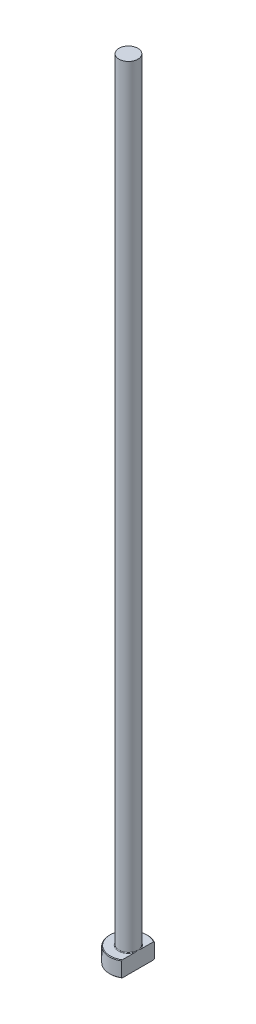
ISO-10303-21;
HEADER;
FILE_DESCRIPTION(('STEP AP214'),'2;1');
FILE_NAME('part.step','',(''),(''),'','','');
FILE_SCHEMA(('AUTOMOTIVE_DESIGN { 1 0 10303 214 1 1 1 1 }'));
ENDSEC;
DATA;
#1=APPLICATION_CONTEXT('core data for automotive mechanical design processes');
#2=APPLICATION_PROTOCOL_DEFINITION('international standard','automotive_design',2000,#1);
#3=PRODUCT_CONTEXT('',#1,'mechanical');
#4=PRODUCT('Part','Part','',(#3));
#5=PRODUCT_RELATED_PRODUCT_CATEGORY('part','',(#4));
#6=PRODUCT_DEFINITION_FORMATION('','',#4);
#7=PRODUCT_DEFINITION_CONTEXT('part definition',#1,'design');
#8=PRODUCT_DEFINITION('design','',#6,#7);
#9=PRODUCT_DEFINITION_SHAPE('','',#8);
#10=(LENGTH_UNIT() NAMED_UNIT(*) SI_UNIT(.MILLI.,.METRE.));
#11=(NAMED_UNIT(*) PLANE_ANGLE_UNIT() SI_UNIT($,.RADIAN.));
#12=(NAMED_UNIT(*) SI_UNIT($,.STERADIAN.) SOLID_ANGLE_UNIT());
#13=UNCERTAINTY_MEASURE_WITH_UNIT(LENGTH_MEASURE(1.E-05),#10,'distance_accuracy_value','');
#14=(GEOMETRIC_REPRESENTATION_CONTEXT(3) GLOBAL_UNCERTAINTY_ASSIGNED_CONTEXT((#13)) GLOBAL_UNIT_ASSIGNED_CONTEXT((#10,
#11,#12)) REPRESENTATION_CONTEXT('',''));
#15=CARTESIAN_POINT('',(0.,0.,0.));
#16=DIRECTION('',(0.,0.,1.));
#17=DIRECTION('',(1.,0.,0.));
#18=AXIS2_PLACEMENT_3D('',#15,#16,#17);
#19=CARTESIAN_POINT('',(0.,0.,0.));
#20=DIRECTION('',(0.,-1.,0.));
#21=DIRECTION('',(0.,0.,-1.));
#22=AXIS2_PLACEMENT_3D('',#19,#20,#21);
#23=PLANE('',#22);
#24=CARTESIAN_POINT('',(0.,0.,0.));
#25=DIRECTION('',(0.,-1.,0.));
#26=DIRECTION('',(0.,0.,-1.));
#27=AXIS2_PLACEMENT_3D('',#24,#25,#26);
#28=CIRCLE('',#27,5.79999999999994);
#29=CARTESIAN_POINT('',(2.99999999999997,0.,4.9638694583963));
#30=VERTEX_POINT('',#29);
#31=CARTESIAN_POINT('',(2.99999999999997,0.,-4.9638694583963));
#32=VERTEX_POINT('',#31);
#33=EDGE_CURVE('E98',#30,#32,#28,.T.);
#34=ORIENTED_EDGE('',*,*,#33,.T.);
#35=DIRECTION('',(0.,0.,1.));
#36=VECTOR('',#35,1.);
#37=CARTESIAN_POINT('',(2.99999999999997,0.,-5.19615242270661));
#38=LINE('',#37,#36);
#39=EDGE_CURVE('E83',#32,#30,#38,.T.);
#40=ORIENTED_EDGE('',*,*,#39,.T.);
#41=EDGE_LOOP('',(#34,#40));
#42=FACE_BOUND('',#41,.T.);
#43=ADVANCED_FACE('F32',(#42),#23,.T.);
#44=CARTESIAN_POINT('',(0.,259.958771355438,0.));
#45=DIRECTION('',(0.,1.,0.));
#46=DIRECTION('',(0.,0.,1.));
#47=AXIS2_PLACEMENT_3D('',#44,#45,#46);
#48=CYLINDRICAL_SURFACE('',#47,5.99999999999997);
#49=CARTESIAN_POINT('',(0.,4.80000000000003,0.));
#50=DIRECTION('',(0.,1.,0.));
#51=DIRECTION('',(0.,0.,1.));
#52=AXIS2_PLACEMENT_3D('',#49,#50,#51);
#53=CIRCLE('',#52,5.99999999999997);
#54=CARTESIAN_POINT('',(2.99999999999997,4.80000000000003,5.19615242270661));
#55=VERTEX_POINT('',#54);
#56=CARTESIAN_POINT('',(2.99999999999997,4.80000000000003,-5.19615242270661));
#57=VERTEX_POINT('',#56);
#58=EDGE_CURVE('E104',#55,#57,#53,.F.);
#59=ORIENTED_EDGE('',*,*,#58,.T.);
#60=DIRECTION('',(0.,-1.,0.));
#61=VECTOR('',#60,1.);
#62=CARTESIAN_POINT('',(2.99999999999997,250.,-5.19615242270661));
#63=LINE('',#62,#61);
#64=CARTESIAN_POINT('',(2.99999999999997,0.200000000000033,-5.19615242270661));
#65=VERTEX_POINT('',#64);
#66=EDGE_CURVE('E183',#57,#65,#63,.T.);
#67=ORIENTED_EDGE('',*,*,#66,.T.);
#68=CARTESIAN_POINT('',(0.,0.200000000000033,0.));
#69=DIRECTION('',(0.,-1.,0.));
#70=DIRECTION('',(0.,0.,-1.));
#71=AXIS2_PLACEMENT_3D('',#68,#69,#70);
#72=CIRCLE('',#71,5.99999999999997);
#73=CARTESIAN_POINT('',(2.99999999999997,0.200000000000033,5.19615242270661));
#74=VERTEX_POINT('',#73);
#75=EDGE_CURVE('E100',#65,#74,#72,.F.);
#76=ORIENTED_EDGE('',*,*,#75,.T.);
#77=DIRECTION('',(0.,-1.,0.));
#78=VECTOR('',#77,1.);
#79=CARTESIAN_POINT('',(2.99999999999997,250.,5.19615242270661));
#80=LINE('',#79,#78);
#81=EDGE_CURVE('E93',#55,#74,#80,.T.);
#82=ORIENTED_EDGE('',*,*,#81,.F.);
#83=EDGE_LOOP('',(#59,#67,#76,#82));
#84=FACE_BOUND('',#83,.T.);
#85=ADVANCED_FACE('F158',(#84),#48,.T.);
#86=CARTESIAN_POINT('',(-5.99999999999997,5.,0.));
#87=DIRECTION('',(0.,1.,0.));
#88=DIRECTION('',(0.,0.,1.));
#89=AXIS2_PLACEMENT_3D('',#86,#87,#88);
#90=PLANE('',#89);
#91=CARTESIAN_POINT('',(0.,5.,0.));
#92=DIRECTION('',(0.,1.,0.));
#93=DIRECTION('',(0.,0.,1.));
#94=AXIS2_PLACEMENT_3D('',#91,#92,#93);
#95=CIRCLE('',#94,5.79999999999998);
#96=CARTESIAN_POINT('',(2.99999999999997,5.,-4.96386945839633));
#97=VERTEX_POINT('',#96);
#98=CARTESIAN_POINT('',(2.99999999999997,5.,4.96386945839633));
#99=VERTEX_POINT('',#98);
#100=EDGE_CURVE('E178',#97,#99,#95,.T.);
#101=ORIENTED_EDGE('',*,*,#100,.T.);
#102=DIRECTION('',(0.,0.,-1.));
#103=VECTOR('',#102,1.);
#104=CARTESIAN_POINT('',(2.99999999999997,5.,0.));
#105=LINE('',#104,#103);
#106=CARTESIAN_POINT('',(2.99999999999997,4.99999999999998,1.11355287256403));
#107=VERTEX_POINT('',#106);
#108=EDGE_CURVE('E57',#99,#107,#105,.T.);
#109=ORIENTED_EDGE('',*,*,#108,.T.);
#110=CARTESIAN_POINT('',(0.,5.,0.));
#111=DIRECTION('',(0.,1.,0.));
#112=DIRECTION('',(0.,0.,1.));
#113=AXIS2_PLACEMENT_3D('',#110,#111,#112);
#114=CIRCLE('',#113,3.19999999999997);
#115=CARTESIAN_POINT('',(2.99999999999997,4.99999999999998,-1.113552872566));
#116=VERTEX_POINT('',#115);
#117=EDGE_CURVE('E107',#107,#116,#114,.F.);
#118=ORIENTED_EDGE('',*,*,#117,.T.);
#119=EDGE_CURVE('E136',#116,#97,#105,.T.);
#120=ORIENTED_EDGE('',*,*,#119,.T.);
#121=EDGE_LOOP('',(#101,#109,#118,#120));
#122=FACE_BOUND('',#121,.T.);
#123=ADVANCED_FACE('F147',(#122),#90,.T.);
#124=CARTESIAN_POINT('',(0.,5.,0.));
#125=DIRECTION('',(0.,-1.,0.));
#126=DIRECTION('',(0.,0.,-1.));
#127=AXIS2_PLACEMENT_3D('',#124,#125,#126);
#128=CONICAL_SURFACE('',#127,5.79999999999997,0.785398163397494);
#129=ORIENTED_EDGE('',*,*,#58,.F.);
#130=CARTESIAN_POINT('',(2.99999999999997,-1.01993959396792,11.432889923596));
#131=CARTESIAN_POINT('',(2.99999999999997,-0.769424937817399,11.1738796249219));
#132=CARTESIAN_POINT('',(2.99999999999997,-0.519179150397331,10.9146084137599));
#133=CARTESIAN_POINT('',(2.99999999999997,-0.0193842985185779,10.395389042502));
#134=CARTESIAN_POINT('',(2.99999999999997,0.230164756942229,10.1354408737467));
#135=CARTESIAN_POINT('',(2.99999999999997,0.728528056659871,9.61458602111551));
#136=CARTESIAN_POINT('',(2.99999999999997,0.977341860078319,9.35367891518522));
#137=CARTESIAN_POINT('',(2.99999999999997,1.47386965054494,8.83082274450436));
#138=CARTESIAN_POINT('',(2.99999999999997,1.72158364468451,8.56887368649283));
#139=CARTESIAN_POINT('',(2.99999999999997,2.21069282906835,8.04884148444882));
#140=CARTESIAN_POINT('',(2.99999999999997,2.4521159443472,7.79078462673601));
#141=CARTESIAN_POINT('',(2.99999999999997,2.93315589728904,7.27299342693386));
#142=CARTESIAN_POINT('',(2.99999999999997,3.17277274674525,7.01325909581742));
#143=CARTESIAN_POINT('',(2.99999999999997,3.64950020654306,6.49159990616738));
#144=CARTESIAN_POINT('',(2.99999999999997,3.88661134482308,6.22967553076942));
#145=CARTESIAN_POINT('',(2.99999999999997,4.35738571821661,5.70275148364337));
#146=CARTESIAN_POINT('',(2.99999999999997,4.59104909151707,5.43775193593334));
#147=CARTESIAN_POINT('',(2.99999999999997,4.96416348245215,5.00636825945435));
#148=CARTESIAN_POINT('',(2.99999999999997,5.1052013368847,4.8413584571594));
#149=CARTESIAN_POINT('',(2.99999999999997,5.38476673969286,4.50919282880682));
#150=CARTESIAN_POINT('',(2.99999999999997,5.52329404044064,4.34203679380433));
#151=CARTESIAN_POINT('',(2.99999999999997,5.79842961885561,4.0031993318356));
#152=CARTESIAN_POINT('',(2.99999999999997,5.93500216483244,3.83148875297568));
#153=CARTESIAN_POINT('',(2.99999999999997,6.20336281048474,3.4844211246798));
#154=CARTESIAN_POINT('',(2.99999999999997,6.33515205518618,3.30906496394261));
#155=CARTESIAN_POINT('',(2.99999999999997,6.5939338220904,2.9507080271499));
#156=CARTESIAN_POINT('',(2.99999999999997,6.72082315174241,2.76763161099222));
#157=CARTESIAN_POINT('',(2.99999999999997,6.90336321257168,2.48771743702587));
#158=CARTESIAN_POINT('',(2.99999999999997,6.96295431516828,2.39345390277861));
#159=CARTESIAN_POINT('',(2.99999999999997,7.07882720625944,2.20292146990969));
#160=CARTESIAN_POINT('',(2.99999999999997,7.13510937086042,2.10665280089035));
#161=CARTESIAN_POINT('',(2.99999999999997,7.24288059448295,1.91297779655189));
#162=CARTESIAN_POINT('',(2.99999999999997,7.29441986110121,1.81559978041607));
#163=CARTESIAN_POINT('',(2.99999999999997,7.39241237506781,1.61833215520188));
#164=CARTESIAN_POINT('',(2.99999999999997,7.43886469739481,1.51844209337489));
#165=CARTESIAN_POINT('',(2.99999999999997,7.56840030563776,1.21511948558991));
#166=CARTESIAN_POINT('',(2.99999999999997,7.64209011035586,1.00730397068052));
#167=CARTESIAN_POINT('',(2.99999999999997,7.72186700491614,0.695731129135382));
#168=CARTESIAN_POINT('',(2.99999999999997,7.74302901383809,0.595791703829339));
#169=CARTESIAN_POINT('',(2.99999999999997,7.77582528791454,0.394325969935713));
#170=CARTESIAN_POINT('',(2.99999999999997,7.78746040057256,0.292799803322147));
#171=CARTESIAN_POINT('',(2.99999999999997,7.80037895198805,0.0893987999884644));
#172=CARTESIAN_POINT('',(2.99999999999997,7.80169449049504,-0.0124739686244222));
#173=CARTESIAN_POINT('',(2.99999999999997,7.79396363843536,-0.215826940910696));
#174=CARTESIAN_POINT('',(2.99999999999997,7.78491639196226,-0.317307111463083));
#175=CARTESIAN_POINT('',(2.99999999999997,7.75721241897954,-0.518039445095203));
#176=CARTESIAN_POINT('',(2.99999999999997,7.73863812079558,-0.61730321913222));
#177=CARTESIAN_POINT('',(2.99999999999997,7.6930395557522,-0.813850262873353));
#178=CARTESIAN_POINT('',(2.99999999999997,7.66601427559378,-0.911133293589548));
#179=CARTESIAN_POINT('',(2.99999999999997,7.60464499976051,-1.10394843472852));
#180=CARTESIAN_POINT('',(2.99999999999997,7.57025976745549,-1.19946724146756));
#181=CARTESIAN_POINT('',(2.99999999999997,7.4955576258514,-1.38810736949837));
#182=CARTESIAN_POINT('',(2.99999999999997,7.45524192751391,-1.48122917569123));
#183=CARTESIAN_POINT('',(2.99999999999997,7.36961028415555,-1.66561491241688));
#184=CARTESIAN_POINT('',(2.99999999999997,7.32427350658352,-1.75686908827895));
#185=CARTESIAN_POINT('',(2.99999999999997,7.22966073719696,-1.93732130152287));
#186=CARTESIAN_POINT('',(2.99999999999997,7.18038388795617,-2.02651888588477));
#187=CARTESIAN_POINT('',(2.99999999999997,7.02771106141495,-2.29153460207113));
#188=CARTESIAN_POINT('',(2.99999999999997,6.91955486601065,-2.46460625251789));
#189=CARTESIAN_POINT('',(2.99999999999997,6.69440299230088,-2.80577028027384));
#190=CARTESIAN_POINT('',(2.99999999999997,6.57737415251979,-2.97384034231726));
#191=CARTESIAN_POINT('',(2.99999999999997,6.33748949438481,-3.30561771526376));
#192=CARTESIAN_POINT('',(2.99999999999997,6.21463662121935,-3.46932716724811));
#193=CARTESIAN_POINT('',(2.99999999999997,5.96308085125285,-3.79561670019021));
#194=CARTESIAN_POINT('',(2.99999999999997,5.83432224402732,-3.95815356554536));
#195=CARTESIAN_POINT('',(2.99999999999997,5.57361365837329,-4.28066737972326));
#196=CARTESIAN_POINT('',(2.99999999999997,5.44166333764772,-4.44064405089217));
#197=CARTESIAN_POINT('',(2.99999999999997,5.17568445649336,-4.75819552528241));
#198=CARTESIAN_POINT('',(2.99999999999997,5.04166171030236,-4.91577521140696));
#199=CARTESIAN_POINT('',(2.99999999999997,4.77176230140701,-5.22934053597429));
#200=CARTESIAN_POINT('',(2.99999999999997,4.63588560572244,-5.38532614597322));
#201=CARTESIAN_POINT('',(2.99999999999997,4.27256222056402,-5.79849838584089));
#202=CARTESIAN_POINT('',(2.99999999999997,4.04384014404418,-6.054562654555));
#203=CARTESIAN_POINT('',(2.99999999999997,3.58360020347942,-6.5641703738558));
#204=CARTESIAN_POINT('',(2.99999999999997,3.35208226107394,-6.81771375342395));
#205=CARTESIAN_POINT('',(2.99999999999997,2.88678846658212,-7.32315936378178));
#206=CARTESIAN_POINT('',(2.99999999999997,2.65301069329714,-7.57505982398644));
#207=CARTESIAN_POINT('',(2.99999999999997,2.18392232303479,-8.07742926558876));
#208=CARTESIAN_POINT('',(2.99999999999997,1.94861172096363,-8.32789824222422));
#209=CARTESIAN_POINT('',(2.99999999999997,1.4865158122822,-8.81743943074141));
#210=CARTESIAN_POINT('',(2.99999999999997,1.25977806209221,-9.05655656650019));
#211=CARTESIAN_POINT('',(2.99999999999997,0.805439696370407,-9.53397105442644));
#212=CARTESIAN_POINT('',(2.99999999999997,0.577839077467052,-9.77226840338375));
#213=CARTESIAN_POINT('',(2.99999999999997,0.122198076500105,-10.2479325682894));
#214=CARTESIAN_POINT('',(2.99999999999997,-0.105841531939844,-10.4853001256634));
#215=CARTESIAN_POINT('',(2.99999999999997,-0.562491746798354,-10.9594816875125));
#216=CARTESIAN_POINT('',(2.99999999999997,-0.791102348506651,-11.1962956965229));
#217=CARTESIAN_POINT('',(2.99999999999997,-1.01993959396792,-11.432889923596));
#218=B_SPLINE_CURVE_WITH_KNOTS('',3,(#130,#131,#132,#133,#134,#135,#136,#137,#138,#139,#140,
#141,#142,#143,#144,#145,#146,#147,#148,#149,#150,#151,#152,#153,#154,#155,#156,#157,#158,#159,
#160,#161,#162,#163,#164,#165,#166,#167,#168,#169,#170,#171,#172,#173,#174,#175,#176,#177,#178,
#179,#180,#181,#182,#183,#184,#185,#186,#187,#188,#189,#190,#191,#192,#193,#194,#195,#196,#197,
#198,#199,#200,#201,#202,#203,#204,#205,#206,#207,#208,#209,#210,#211,#212,#213,#214,#215,#216,
#217),.UNSPECIFIED.,.F.,.F.,(4,2,2,2,2,2,2,2,2,2,2,2,2,2,2,2,2,2,2,2,2,2,2,2,2,2,2,2,2,2,2,2,2,
2,2,2,2,2,2,2,2,2,2,4),(0.,1.08101662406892,2.16204714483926,3.24363027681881,4.32520642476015,
5.3853446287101,6.44547590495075,7.50537917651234,8.56523985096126,9.21643479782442,
9.86769362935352,10.5258323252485,11.1838124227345,11.851781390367,12.1862877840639,
12.5207560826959,12.8511332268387,13.1815703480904,13.8399161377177,14.1460077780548,
14.4520721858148,14.7571841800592,15.0623213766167,15.3648619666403,15.6674388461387,
15.9717575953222,16.2760142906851,16.5815843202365,16.8872210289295,17.4990577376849,
18.1133060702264,18.7272470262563,19.3492675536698,19.9713550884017,20.5919343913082,
21.2125247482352,22.2425132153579,23.2725306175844,24.3035181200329,25.3345090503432,
26.3230827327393,27.3116602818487,28.299135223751,29.286602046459),.UNSPECIFIED.);
#219=EDGE_CURVE('E135',#55,#99,#218,.T.);
#220=ORIENTED_EDGE('',*,*,#219,.T.);
#221=ORIENTED_EDGE('',*,*,#100,.F.);
#222=EDGE_CURVE('E127',#97,#57,#218,.T.);
#223=ORIENTED_EDGE('',*,*,#222,.T.);
#224=EDGE_LOOP('',(#129,#220,#221,#223));
#225=FACE_BOUND('',#224,.T.);
#226=ADVANCED_FACE('F143',(#225),#128,.T.);
#227=CARTESIAN_POINT('',(0.,0.200000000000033,0.));
#228=DIRECTION('',(0.,1.,0.));
#229=DIRECTION('',(0.,0.,1.));
#230=AXIS2_PLACEMENT_3D('',#227,#228,#229);
#231=CONICAL_SURFACE('',#230,5.99999999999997,0.785398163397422);
#232=ORIENTED_EDGE('',*,*,#75,.F.);
#233=CARTESIAN_POINT('',(2.99999999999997,6.01993959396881,-11.432889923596));
#234=CARTESIAN_POINT('',(2.99999999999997,5.76942493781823,-11.1738796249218));
#235=CARTESIAN_POINT('',(2.99999999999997,5.5191791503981,-10.9146084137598));
#236=CARTESIAN_POINT('',(2.99999999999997,5.01938429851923,-10.3953890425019));
#237=CARTESIAN_POINT('',(2.99999999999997,4.76983524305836,-10.1354408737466));
#238=CARTESIAN_POINT('',(2.99999999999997,4.27147194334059,-9.61458602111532));
#239=CARTESIAN_POINT('',(2.99999999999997,4.02265813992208,-9.35367891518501));
#240=CARTESIAN_POINT('',(2.99999999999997,3.52613034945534,-8.83082274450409));
#241=CARTESIAN_POINT('',(2.99999999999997,3.27841635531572,-8.56887368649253));
#242=CARTESIAN_POINT('',(2.99999999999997,2.78930717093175,-8.04884148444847));
#243=CARTESIAN_POINT('',(2.99999999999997,2.54788405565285,-7.79078462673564));
#244=CARTESIAN_POINT('',(2.99999999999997,2.0668441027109,-7.27299342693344));
#245=CARTESIAN_POINT('',(2.99999999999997,1.82722725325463,-7.01325909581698));
#246=CARTESIAN_POINT('',(2.99999999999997,1.35049979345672,-6.49159990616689));
#247=CARTESIAN_POINT('',(2.99999999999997,1.11338865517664,-6.2296755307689));
#248=CARTESIAN_POINT('',(2.99999999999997,0.642614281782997,-5.70275148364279));
#249=CARTESIAN_POINT('',(2.99999999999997,0.408950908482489,-5.43775193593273));
#250=CARTESIAN_POINT('',(2.99999999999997,0.0358365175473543,-5.00636825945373));
#251=CARTESIAN_POINT('',(2.99999999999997,-0.105201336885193,-4.8413584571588));
#252=CARTESIAN_POINT('',(2.99999999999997,-0.384766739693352,-4.50919282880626));
#253=CARTESIAN_POINT('',(2.99999999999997,-0.523294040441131,-4.34203679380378));
#254=CARTESIAN_POINT('',(2.99999999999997,-0.7984296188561,-4.00319933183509));
#255=CARTESIAN_POINT('',(2.99999999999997,-0.935002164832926,-3.83148875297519));
#256=CARTESIAN_POINT('',(2.99999999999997,-1.20336281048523,-3.48442112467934));
#257=CARTESIAN_POINT('',(2.99999999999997,-1.33515205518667,-3.30906496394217));
#258=CARTESIAN_POINT('',(2.99999999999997,-1.59393382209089,-2.95070802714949));
#259=CARTESIAN_POINT('',(2.99999999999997,-1.7208231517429,-2.76763161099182));
#260=CARTESIAN_POINT('',(2.99999999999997,-1.90336321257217,-2.48771743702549));
#261=CARTESIAN_POINT('',(2.99999999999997,-1.96295431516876,-2.39345390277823));
#262=CARTESIAN_POINT('',(2.99999999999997,-2.07882720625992,-2.20292146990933));
#263=CARTESIAN_POINT('',(2.99999999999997,-2.1351093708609,-2.10665280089));
#264=CARTESIAN_POINT('',(2.99999999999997,-2.24288059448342,-1.91297779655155));
#265=CARTESIAN_POINT('',(2.99999999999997,-2.29441986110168,-1.81559978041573));
#266=CARTESIAN_POINT('',(2.99999999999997,-2.39241237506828,-1.61833215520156));
#267=CARTESIAN_POINT('',(2.99999999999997,-2.43886469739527,-1.51844209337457));
#268=CARTESIAN_POINT('',(2.99999999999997,-2.56840030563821,-1.2151194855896));
#269=CARTESIAN_POINT('',(2.99999999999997,-2.6420901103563,-1.00730397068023));
#270=CARTESIAN_POINT('',(2.99999999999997,-2.72186700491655,-0.69573112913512));
#271=CARTESIAN_POINT('',(2.99999999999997,-2.7430290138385,-0.595791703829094));
#272=CARTESIAN_POINT('',(2.99999999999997,-2.77582528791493,-0.394325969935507));
#273=CARTESIAN_POINT('',(2.99999999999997,-2.78746040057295,-0.292799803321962));
#274=CARTESIAN_POINT('',(2.99999999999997,-2.80037895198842,-0.0893987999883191));
#275=CARTESIAN_POINT('',(2.99999999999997,-2.8016944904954,0.0124739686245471));
#276=CARTESIAN_POINT('',(2.99999999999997,-2.79396363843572,0.215826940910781));
#277=CARTESIAN_POINT('',(2.99999999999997,-2.78491639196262,0.317307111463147));
#278=CARTESIAN_POINT('',(2.99999999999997,-2.7572124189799,0.518039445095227));
#279=CARTESIAN_POINT('',(2.99999999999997,-2.73863812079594,0.617303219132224));
#280=CARTESIAN_POINT('',(2.99999999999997,-2.69303955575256,0.813850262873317));
#281=CARTESIAN_POINT('',(2.99999999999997,-2.66601427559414,0.911133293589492));
#282=CARTESIAN_POINT('',(2.99999999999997,-2.60464499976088,1.10394843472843));
#283=CARTESIAN_POINT('',(2.99999999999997,-2.57025976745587,1.19946724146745));
#284=CARTESIAN_POINT('',(2.99999999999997,-2.49555762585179,1.38810736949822));
#285=CARTESIAN_POINT('',(2.99999999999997,-2.4552419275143,1.48122917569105));
#286=CARTESIAN_POINT('',(2.99999999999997,-2.36961028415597,1.66561491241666));
#287=CARTESIAN_POINT('',(2.99999999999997,-2.32427350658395,1.7568690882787));
#288=CARTESIAN_POINT('',(2.99999999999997,-2.22966073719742,1.93732130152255));
#289=CARTESIAN_POINT('',(2.99999999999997,-2.18038388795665,2.02651888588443));
#290=CARTESIAN_POINT('',(2.99999999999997,-2.02771106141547,2.2915346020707));
#291=CARTESIAN_POINT('',(2.99999999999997,-1.91955486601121,2.4646062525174));
#292=CARTESIAN_POINT('',(2.99999999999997,-1.6944029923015,2.80577028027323));
#293=CARTESIAN_POINT('',(2.99999999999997,-1.57737415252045,2.9738403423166));
#294=CARTESIAN_POINT('',(2.99999999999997,-1.33748949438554,3.30561771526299));
#295=CARTESIAN_POINT('',(2.99999999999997,-1.21463662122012,3.46932716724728));
#296=CARTESIAN_POINT('',(2.99999999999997,-0.96308085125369,3.79561670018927));
#297=CARTESIAN_POINT('',(2.99999999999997,-0.834322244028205,3.95815356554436));
#298=CARTESIAN_POINT('',(2.99999999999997,-0.573613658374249,4.28066737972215));
#299=CARTESIAN_POINT('',(2.99999999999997,-0.441663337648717,4.440644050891));
#300=CARTESIAN_POINT('',(2.99999999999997,-0.175684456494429,4.75819552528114));
#301=CARTESIAN_POINT('',(2.99999999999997,-0.0416617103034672,4.91577521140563));
#302=CARTESIAN_POINT('',(2.99999999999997,0.228237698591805,5.22934053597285));
#303=CARTESIAN_POINT('',(2.99999999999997,0.364114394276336,5.38532614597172));
#304=CARTESIAN_POINT('',(2.99999999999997,0.727437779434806,5.79849838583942));
#305=CARTESIAN_POINT('',(2.99999999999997,0.956159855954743,6.05456265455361));
#306=CARTESIAN_POINT('',(2.99999999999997,1.41639979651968,6.56417037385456));
#307=CARTESIAN_POINT('',(2.99999999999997,1.64791773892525,6.81771375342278));
#308=CARTESIAN_POINT('',(2.99999999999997,2.11321153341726,7.32315936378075));
#309=CARTESIAN_POINT('',(2.99999999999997,2.34698930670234,7.57505982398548));
#310=CARTESIAN_POINT('',(2.99999999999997,2.81607767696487,8.07742926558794));
#311=CARTESIAN_POINT('',(2.99999999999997,3.05138827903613,8.32789824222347));
#312=CARTESIAN_POINT('',(2.99999999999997,3.51348418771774,8.81743943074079));
#313=CARTESIAN_POINT('',(2.99999999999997,3.74022193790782,9.05655656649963));
#314=CARTESIAN_POINT('',(2.99999999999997,4.1945603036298,9.53397105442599));
#315=CARTESIAN_POINT('',(2.99999999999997,4.42216092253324,9.77226840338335));
#316=CARTESIAN_POINT('',(2.99999999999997,4.87780192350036,10.2479325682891));
#317=CARTESIAN_POINT('',(2.99999999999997,5.10584153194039,10.4853001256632));
#318=CARTESIAN_POINT('',(2.99999999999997,5.56249174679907,10.9594816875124));
#319=CARTESIAN_POINT('',(2.99999999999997,5.79110234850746,11.1962956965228));
#320=CARTESIAN_POINT('',(2.99999999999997,6.01993959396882,11.432889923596));
#321=B_SPLINE_CURVE_WITH_KNOTS('',3,(#233,#234,#235,#236,#237,#238,#239,#240,#241,#242,#243,
#244,#245,#246,#247,#248,#249,#250,#251,#252,#253,#254,#255,#256,#257,#258,#259,#260,#261,#262,
#263,#264,#265,#266,#267,#268,#269,#270,#271,#272,#273,#274,#275,#276,#277,#278,#279,#280,#281,
#282,#283,#284,#285,#286,#287,#288,#289,#290,#291,#292,#293,#294,#295,#296,#297,#298,#299,#300,
#301,#302,#303,#304,#305,#306,#307,#308,#309,#310,#311,#312,#313,#314,#315,#316,#317,#318,#319,
#320),.UNSPECIFIED.,.F.,.F.,(4,2,2,2,2,2,2,2,2,2,2,2,2,2,2,2,2,2,2,2,2,2,2,2,2,2,2,2,2,2,2,2,2,
2,2,2,2,2,2,2,2,2,2,4),(0.,1.08101662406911,2.16204714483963,3.24363027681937,4.32520642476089,
5.38534462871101,6.44547590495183,7.50537917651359,8.56523985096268,9.21643479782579,
9.86769362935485,10.5258323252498,11.1838124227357,11.8517813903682,12.1862877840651,
12.5207560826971,12.8511332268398,13.1815703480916,13.8399161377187,14.1460077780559,
14.4520721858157,14.7571841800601,15.0623213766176,15.3648619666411,15.6674388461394,
15.9717575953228,16.2760142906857,16.581584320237,16.8872210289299,17.4990577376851,
18.1133060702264,18.7272470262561,19.3492675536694,19.9713550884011,20.5919343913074,
21.2125247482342,22.2425132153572,23.2725306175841,24.3035181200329,25.3345090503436,
26.32308273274,27.3116602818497,28.2991352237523,29.2866020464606),.UNSPECIFIED.);
#322=EDGE_CURVE('E86',#65,#32,#321,.T.);
#323=ORIENTED_EDGE('',*,*,#322,.T.);
#324=ORIENTED_EDGE('',*,*,#33,.F.);
#325=EDGE_CURVE('E89',#30,#74,#321,.T.);
#326=ORIENTED_EDGE('',*,*,#325,.T.);
#327=EDGE_LOOP('',(#232,#323,#324,#326));
#328=FACE_BOUND('',#327,.T.);
#329=ADVANCED_FACE('F97',(#328),#231,.T.);
#330=CARTESIAN_POINT('',(0.,5.19999999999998,0.));
#331=DIRECTION('',(0.,1.,0.));
#332=DIRECTION('',(0.,0.,1.));
#333=AXIS2_PLACEMENT_3D('',#330,#331,#332);
#334=TOROIDAL_SURFACE('',#333,3.19999999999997,0.2);
#335=CARTESIAN_POINT('',(2.99999999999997,5.19999999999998,0.));
#336=CARTESIAN_POINT('',(2.99999999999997,5.20000054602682,-8.25589702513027E-09));
#337=CARTESIAN_POINT('',(2.99999999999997,5.20000108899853,-2.22623702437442E-07));
#338=CARTESIAN_POINT('',(2.99999999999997,5.20000210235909,-8.13181300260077E-07));
#339=CARTESIAN_POINT('',(2.99999999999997,5.20000256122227,-1.20262206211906E-06));
#340=CARTESIAN_POINT('',(2.99999999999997,5.20000351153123,-2.13233189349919E-06));
#341=CARTESIAN_POINT('',(2.99999999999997,5.2000039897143,-2.68711073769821E-06));
#342=CARTESIAN_POINT('',(2.99999999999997,5.20000484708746,-3.83722986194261E-06));
#343=CARTESIAN_POINT('',(2.99999999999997,5.20000522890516,-4.43075968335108E-06));
#344=CARTESIAN_POINT('',(2.99999999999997,5.20000663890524,-6.71805399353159E-06));
#345=CARTESIAN_POINT('',(2.99999999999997,5.20000758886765,-8.46267320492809E-06));
#346=CARTESIAN_POINT('',(2.99999999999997,5.20000915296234,-1.19195937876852E-05));
#347=CARTESIAN_POINT('',(2.99999999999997,5.20000978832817,-1.36226966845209E-05));
#348=CARTESIAN_POINT('',(2.99999999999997,5.20001243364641,-2.07785327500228E-05));
#349=CARTESIAN_POINT('',(2.99999999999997,5.20001439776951,-2.62512686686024E-05));
#350=CARTESIAN_POINT('',(2.99999999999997,5.20001730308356,-3.65971251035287E-05));
#351=CARTESIAN_POINT('',(2.99999999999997,5.20001835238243,-4.14397201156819E-05));
#352=CARTESIAN_POINT('',(2.99999999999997,5.20002589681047,-7.68826107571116E-05));
#353=CARTESIAN_POINT('',(2.99999999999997,5.20003169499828,-0.000107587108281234));
#354=CARTESIAN_POINT('',(2.99999999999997,5.20005649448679,-0.000225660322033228));
#355=CARTESIAN_POINT('',(2.99999999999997,5.2000799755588,-0.000312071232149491));
#356=CARTESIAN_POINT('',(2.99999999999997,5.2001671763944,-0.000638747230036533));
#357=CARTESIAN_POINT('',(2.99999999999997,5.20022823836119,-0.000879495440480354));
#358=CARTESIAN_POINT('',(2.99999999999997,5.20046253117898,-0.00179757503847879));
#359=CARTESIAN_POINT('',(2.99999999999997,5.20063826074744,-0.00247448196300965));
#360=CARTESIAN_POINT('',(2.99999999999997,5.20145771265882,-0.00563611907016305));
#361=CARTESIAN_POINT('',(2.99999999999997,5.20209802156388,-0.00812138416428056));
#362=CARTESIAN_POINT('',(2.99999999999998,5.207470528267,-0.0289666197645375));
#363=CARTESIAN_POINT('',(2.99999999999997,5.2122144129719,-0.0473249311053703));
#364=CARTESIAN_POINT('',(2.99999999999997,5.2215041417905,-0.0833908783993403));
#365=CARTESIAN_POINT('',(2.99999999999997,5.22605099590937,-0.101098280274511));
#366=CARTESIAN_POINT('',(2.99999999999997,5.24071513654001,-0.158441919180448));
#367=CARTESIAN_POINT('',(2.99999999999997,5.25076238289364,-0.198096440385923));
#368=CARTESIAN_POINT('',(2.99999999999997,5.26735876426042,-0.264903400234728));
#369=CARTESIAN_POINT('',(2.99999999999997,5.27400650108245,-0.292031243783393));
#370=CARTESIAN_POINT('',(2.99999999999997,5.28691139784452,-0.345693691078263));
#371=CARTESIAN_POINT('',(2.99999999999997,5.29317409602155,-0.372226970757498));
#372=CARTESIAN_POINT('',(2.99999999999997,5.31359314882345,-0.460847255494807));
#373=CARTESIAN_POINT('',(2.99999999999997,5.3271194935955,-0.52308420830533));
#374=CARTESIAN_POINT('',(2.99999999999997,5.35185224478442,-0.648627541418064));
#375=CARTESIAN_POINT('',(2.99999999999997,5.36303576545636,-0.711938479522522));
#376=CARTESIAN_POINT('',(2.99999999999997,5.382697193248,-0.845442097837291));
#377=CARTESIAN_POINT('',(2.99999999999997,5.39079783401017,-0.915695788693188));
#378=CARTESIAN_POINT('',(2.99999999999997,5.39788104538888,-1.02128246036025));
#379=CARTESIAN_POINT('',(2.99999999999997,5.399399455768,-1.05644278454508));
#380=CARTESIAN_POINT('',(2.99999999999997,5.40031405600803,-1.12678521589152));
#381=CARTESIAN_POINT('',(2.99999999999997,5.39971158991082,-1.16196729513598));
#382=CARTESIAN_POINT('',(2.99999999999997,5.39660553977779,-1.21713951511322));
#383=CARTESIAN_POINT('',(2.99999999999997,5.39502683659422,-1.23718181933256));
#384=CARTESIAN_POINT('',(2.99999999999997,5.39080008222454,-1.27717351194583));
#385=CARTESIAN_POINT('',(2.99999999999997,5.38815120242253,-1.29712281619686));
#386=CARTESIAN_POINT('',(2.99999999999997,5.38160570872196,-1.33655702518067));
#387=CARTESIAN_POINT('',(2.99999999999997,5.37772556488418,-1.35604460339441));
#388=CARTESIAN_POINT('',(2.99999999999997,5.36841119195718,-1.39463554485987));
#389=CARTESIAN_POINT('',(2.99999999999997,5.36297874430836,-1.41373932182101));
#390=CARTESIAN_POINT('',(2.99999999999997,5.3500393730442,-1.45151809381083));
#391=CARTESIAN_POINT('',(2.99999999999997,5.34250654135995,-1.47018435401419));
#392=CARTESIAN_POINT('',(2.99999999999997,5.32469433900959,-1.50617232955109));
#393=CARTESIAN_POINT('',(2.99999999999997,5.31442814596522,-1.52349999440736));
#394=CARTESIAN_POINT('',(2.99999999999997,5.29768486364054,-1.5453003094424));
#395=CARTESIAN_POINT('',(2.99999999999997,5.29285641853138,-1.551032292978));
#396=CARTESIAN_POINT('',(2.99999999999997,5.28257691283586,-1.56192749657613));
#397=CARTESIAN_POINT('',(2.99999999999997,5.27712536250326,-1.56709026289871));
#398=CARTESIAN_POINT('',(2.99999999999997,5.26548354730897,-1.57666725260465));
#399=CARTESIAN_POINT('',(2.99999999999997,5.25928560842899,-1.58107232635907));
#400=CARTESIAN_POINT('',(2.99999999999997,5.24620912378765,-1.5887219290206));
#401=CARTESIAN_POINT('',(2.99999999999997,5.23933242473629,-1.59196950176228));
#402=CARTESIAN_POINT('',(2.99999999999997,5.22702406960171,-1.5962468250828));
#403=CARTESIAN_POINT('',(2.99999999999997,5.2217197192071,-1.59764171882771));
#404=CARTESIAN_POINT('',(2.99999999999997,5.2109516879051,-1.59951721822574));
#405=CARTESIAN_POINT('',(2.99999999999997,5.20548813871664,-1.59999855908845));
#406=CARTESIAN_POINT('',(2.99999999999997,5.19455397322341,-1.60000143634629));
#407=CARTESIAN_POINT('',(2.99999999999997,5.18908335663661,-1.59952177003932));
#408=CARTESIAN_POINT('',(2.99999999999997,5.17830149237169,-1.59764696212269));
#409=CARTESIAN_POINT('',(2.99999999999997,5.17299036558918,-1.59625114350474));
#410=CARTESIAN_POINT('',(2.99999999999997,5.16137413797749,-1.5922159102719));
#411=CARTESIAN_POINT('',(2.99999999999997,5.15514663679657,-1.58935479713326));
#412=CARTESIAN_POINT('',(2.99999999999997,5.14323789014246,-1.58266473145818));
#413=CARTESIAN_POINT('',(2.99999999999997,5.13755768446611,-1.57883398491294));
#414=CARTESIAN_POINT('',(2.99999999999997,5.12388989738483,-1.5682309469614));
#415=CARTESIAN_POINT('',(2.99999999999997,5.11627920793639,-1.56097697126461));
#416=CARTESIAN_POINT('',(2.99999999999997,5.10222993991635,-1.54541986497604));
#417=CARTESIAN_POINT('',(2.99999999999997,5.09579438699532,-1.53711411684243));
#418=CARTESIAN_POINT('',(2.99999999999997,5.07874447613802,-1.51234359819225));
#419=CARTESIAN_POINT('',(2.99999999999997,5.06934681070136,-1.49505024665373));
#420=CARTESIAN_POINT('',(2.99999999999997,5.05300413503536,-1.45936637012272));
#421=CARTESIAN_POINT('',(2.99999999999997,5.04606563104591,-1.440973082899));
#422=CARTESIAN_POINT('',(2.99999999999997,5.03343712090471,-1.40170303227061));
#423=CARTESIAN_POINT('',(2.99999999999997,5.02794514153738,-1.38076360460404));
#424=CARTESIAN_POINT('',(2.99999999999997,5.01869119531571,-1.33849708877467));
#425=CARTESIAN_POINT('',(2.99999999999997,5.01493126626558,-1.31716957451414));
#426=CARTESIAN_POINT('',(2.99999999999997,5.00879575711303,-1.27427301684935));
#427=CARTESIAN_POINT('',(2.99999999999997,5.00642327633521,-1.25270354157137));
#428=CARTESIAN_POINT('',(2.99999999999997,5.00283272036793,-1.20948719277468));
#429=CARTESIAN_POINT('',(2.99999999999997,5.00161392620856,-1.18784037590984));
#430=CARTESIAN_POINT('',(2.99999999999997,4.99921193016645,-1.11739576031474));
#431=CARTESIAN_POINT('',(2.99999999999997,4.99998309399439,-1.06853061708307));
#432=CARTESIAN_POINT('',(2.99999999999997,5.00498456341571,-0.970964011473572));
#433=CARTESIAN_POINT('',(2.99999999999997,5.00921876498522,-0.922262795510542));
#434=CARTESIAN_POINT('',(2.99999999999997,5.02027934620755,-0.825023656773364));
#435=CARTESIAN_POINT('',(2.99999999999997,5.02711306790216,-0.776486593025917));
#436=CARTESIAN_POINT('',(2.99999999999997,5.04272509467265,-0.679720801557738));
#437=CARTESIAN_POINT('',(2.99999999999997,5.05150395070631,-0.631492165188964));
#438=CARTESIAN_POINT('',(2.99999999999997,5.07999589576,-0.487173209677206));
#439=CARTESIAN_POINT('',(2.99999999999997,5.10185558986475,-0.391514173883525));
#440=CARTESIAN_POINT('',(2.99999999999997,5.14819769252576,-0.200831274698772));
#441=CARTESIAN_POINT('',(2.99999999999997,5.17268119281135,-0.105807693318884));
#442=CARTESIAN_POINT('',(2.99999999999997,5.19722910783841,-0.0107318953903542));
#443=CARTESIAN_POINT('',(2.99999999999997,5.19724528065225,-0.0106692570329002));
#444=CARTESIAN_POINT('',(2.99999999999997,5.19781243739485,-0.00847232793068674));
#445=CARTESIAN_POINT('',(2.99999999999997,5.19836102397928,-0.00633759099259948));
#446=CARTESIAN_POINT('',(2.99999999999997,5.1991597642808,-0.00325873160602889));
#447=CARTESIAN_POINT('',(2.99999999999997,5.19940591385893,-0.00231386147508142));
#448=CARTESIAN_POINT('',(2.99999999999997,5.19972567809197,-0.00105818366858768));
#449=CARTESIAN_POINT('',(2.99999999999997,5.19980400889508,-0.000748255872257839));
#450=CARTESIAN_POINT('',(2.99999999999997,5.1999122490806,-0.000340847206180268));
#451=CARTESIAN_POINT('',(2.99999999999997,5.19993871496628,-0.000242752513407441));
#452=CARTESIAN_POINT('',(2.99999999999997,5.19996623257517,-0.000111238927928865));
#453=CARTESIAN_POINT('',(2.99999999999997,5.19997237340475,-7.89037769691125E-05));
#454=CARTESIAN_POINT('',(2.99999999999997,5.19998062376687,-4.17973012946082E-05));
#455=CARTESIAN_POINT('',(2.99999999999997,5.19998174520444,-3.68646325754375E-05));
#456=CARTESIAN_POINT('',(2.99999999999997,5.19998486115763,-2.6333709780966E-05));
#457=CARTESIAN_POINT('',(2.99999999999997,5.19998697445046,-2.0770778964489E-05));
#458=CARTESIAN_POINT('',(2.99999999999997,5.19998981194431,-1.35213137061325E-05));
#459=CARTESIAN_POINT('',(2.99999999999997,5.19999048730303,-1.18115060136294E-05));
#460=CARTESIAN_POINT('',(2.99999999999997,5.19999214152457,-8.34771962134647E-06));
#461=CARTESIAN_POINT('',(2.99999999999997,5.19999314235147,-6.60378870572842E-06));
#462=CARTESIAN_POINT('',(2.99999999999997,5.1999946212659,-4.32501646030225E-06));
#463=CARTESIAN_POINT('',(2.99999999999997,5.1999950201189,-3.73587510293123E-06));
#464=CARTESIAN_POINT('',(2.99999999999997,5.19999591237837,-2.59760768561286E-06));
#465=CARTESIAN_POINT('',(2.99999999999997,5.19999640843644,-2.05040430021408E-06));
#466=CARTESIAN_POINT('',(2.99999999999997,5.19999738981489,-1.1384674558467E-06));
#467=CARTESIAN_POINT('',(2.99999999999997,5.19999786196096,-7.58552551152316E-07));
#468=CARTESIAN_POINT('',(2.99999999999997,5.19999889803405,-1.92079005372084E-07));
#469=CARTESIAN_POINT('',(2.99999999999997,5.19999945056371,8.30744745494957E-09));
#470=CARTESIAN_POINT('',(2.99999999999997,5.19999999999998,0.));
#471=B_SPLINE_CURVE_WITH_KNOTS('',3,(#335,#336,#337,#338,#339,#340,#341,#342,#343,#344,#345,
#346,#347,#348,#349,#350,#351,#352,#353,#354,#355,#356,#357,#358,#359,#360,#361,#362,#363,#364,
#365,#366,#367,#368,#369,#370,#371,#372,#373,#374,#375,#376,#377,#378,#379,#380,#381,#382,#383,
#384,#385,#386,#387,#388,#389,#390,#391,#392,#393,#394,#395,#396,#397,#398,#399,#400,#401,#402,
#403,#404,#405,#406,#407,#408,#409,#410,#411,#412,#413,#414,#415,#416,#417,#418,#419,#420,#421,
#422,#423,#424,#425,#426,#427,#428,#429,#430,#431,#432,#433,#434,#435,#436,#437,#438,#439,#440,
#441,#442,#443,#444,#445,#446,#447,#448,#449,#450,#451,#452,#453,#454,#455,#456,#457,#458,#459,
#460,#461,#462,#463,#464,#465,#466,#467,#468,#469,#470),.UNSPECIFIED.,.T.,.F.,(4,2,2,2,2,2,2,2,
2,2,2,2,2,2,2,2,2,2,2,2,2,2,2,2,2,2,2,2,2,2,2,2,2,2,2,2,2,2,2,2,2,2,2,2,2,2,2,2,2,2,2,2,2,2,2,2,
2,2,2,2,2,2,2,2,2,2,2,4),(0.,1.65204701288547E-06,3.45848810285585E-06,5.64280272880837E-06,
7.75882449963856E-06,1.36969712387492E-05,1.9145444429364E-05,3.65603925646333E-05,
5.14083087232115E-05,0.000145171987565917,0.000413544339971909,0.00115890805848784,
0.00325667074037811,0.0109563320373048,0.067838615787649,0.122684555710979,0.245405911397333,
0.329196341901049,0.410983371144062,0.602016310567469,0.79483628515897,1.00673763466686,
1.11227258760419,1.21774067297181,1.27803175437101,1.33836960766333,1.39793215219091,
1.45742661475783,1.51769013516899,1.57766822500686,1.60011625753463,1.62258205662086,
1.64530254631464,1.66796284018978,1.68434680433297,1.70071757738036,1.71710885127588,
1.7335122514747,1.75395806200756,1.77444198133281,1.8058056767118,1.83724902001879,
1.89596356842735,1.95483231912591,2.01967230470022,2.08458838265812,2.14964892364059,
2.21466889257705,2.3610799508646,2.50765595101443,2.65464904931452,2.80168383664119,
3.09594779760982,3.39033467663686,3.39052875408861,3.3971415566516,3.40007033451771,
3.40102967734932,3.4013342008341,3.40143296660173,3.40144812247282,3.40146594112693,
3.40147145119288,3.401477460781,3.40147959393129,3.40148179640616,3.40148361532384,
3.40148527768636),.UNSPECIFIED.);
#472=CARTESIAN_POINT('',(2.99999999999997,5.19999999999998,0.));
#473=VERTEX_POINT('',#472);
#474=EDGE_CURVE('E11',#116,#473,#471,.T.);
#475=ORIENTED_EDGE('',*,*,#474,.F.);
#476=ORIENTED_EDGE('',*,*,#117,.F.);
#477=CARTESIAN_POINT('',(2.99999999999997,5.19999999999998,0.));
#478=CARTESIAN_POINT('',(2.99999999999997,5.19999945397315,8.25589702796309E-09));
#479=CARTESIAN_POINT('',(2.99999999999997,5.19999891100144,2.22623702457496E-07));
#480=CARTESIAN_POINT('',(2.99999999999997,5.19999789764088,8.13181300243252E-07));
#481=CARTESIAN_POINT('',(2.99999999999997,5.19999743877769,1.20262206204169E-06));
#482=CARTESIAN_POINT('',(2.99999999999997,5.19999648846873,2.13233189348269E-06));
#483=CARTESIAN_POINT('',(2.99999999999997,5.19999601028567,2.68711073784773E-06));
#484=CARTESIAN_POINT('',(2.99999999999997,5.19999515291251,3.83722986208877E-06));
#485=CARTESIAN_POINT('',(2.99999999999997,5.1999947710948,4.43075968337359E-06));
#486=CARTESIAN_POINT('',(2.99999999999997,5.19999336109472,6.71805399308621E-06));
#487=CARTESIAN_POINT('',(2.99999999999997,5.19999241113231,8.46267320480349E-06));
#488=CARTESIAN_POINT('',(2.99999999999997,5.19999084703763,1.19195937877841E-05));
#489=CARTESIAN_POINT('',(2.99999999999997,5.1999902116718,1.36226966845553E-05));
#490=CARTESIAN_POINT('',(2.99999999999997,5.19998756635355,2.07785327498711E-05));
#491=CARTESIAN_POINT('',(2.99999999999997,5.19998560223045,2.62512686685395E-05));
#492=CARTESIAN_POINT('',(2.99999999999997,5.1999826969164,3.65971251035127E-05));
#493=CARTESIAN_POINT('',(2.99999999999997,5.19998164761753,4.14397201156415E-05));
#494=CARTESIAN_POINT('',(2.99999999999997,5.19997410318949,7.68826107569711E-05));
#495=CARTESIAN_POINT('',(2.99999999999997,5.19996830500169,0.000107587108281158));
#496=CARTESIAN_POINT('',(2.99999999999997,5.19994350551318,0.000225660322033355));
#497=CARTESIAN_POINT('',(2.99999999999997,5.19992002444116,0.000312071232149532));
#498=CARTESIAN_POINT('',(2.99999999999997,5.19983282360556,0.000638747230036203));
#499=CARTESIAN_POINT('',(2.99999999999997,5.19977176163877,0.000879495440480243));
#500=CARTESIAN_POINT('',(2.99999999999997,5.19953746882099,0.00179757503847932));
#501=CARTESIAN_POINT('',(2.99999999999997,5.19936173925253,0.00247448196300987));
#502=CARTESIAN_POINT('',(2.99999999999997,5.19854228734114,0.00563611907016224));
#503=CARTESIAN_POINT('',(2.99999999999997,5.19790197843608,0.0081213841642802));
#504=CARTESIAN_POINT('',(2.99999999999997,5.19252947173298,0.0289666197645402));
#505=CARTESIAN_POINT('',(2.99999999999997,5.18778558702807,0.0473249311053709));
#506=CARTESIAN_POINT('',(2.99999999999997,5.17849585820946,0.0833908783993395));
#507=CARTESIAN_POINT('',(2.99999999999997,5.17394900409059,0.101098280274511));
#508=CARTESIAN_POINT('',(2.99999999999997,5.15928486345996,0.158441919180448));
#509=CARTESIAN_POINT('',(2.99999999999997,5.14923761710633,0.198096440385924));
#510=CARTESIAN_POINT('',(2.99999999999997,5.13264123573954,0.264903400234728));
#511=CARTESIAN_POINT('',(2.99999999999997,5.12599349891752,0.292031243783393));
#512=CARTESIAN_POINT('',(2.99999999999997,5.11308860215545,0.345693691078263));
#513=CARTESIAN_POINT('',(2.99999999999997,5.10682590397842,0.372226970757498));
#514=CARTESIAN_POINT('',(2.99999999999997,5.08640685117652,0.460847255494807));
#515=CARTESIAN_POINT('',(2.99999999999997,5.07288050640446,0.52308420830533));
#516=CARTESIAN_POINT('',(2.99999999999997,5.04814775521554,0.648627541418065));
#517=CARTESIAN_POINT('',(2.99999999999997,5.0369642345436,0.711938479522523));
#518=CARTESIAN_POINT('',(2.99999999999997,5.01730280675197,0.845442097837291));
#519=CARTESIAN_POINT('',(2.99999999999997,5.0092021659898,0.915695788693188));
#520=CARTESIAN_POINT('',(2.99999999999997,5.00211895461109,1.02128246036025));
#521=CARTESIAN_POINT('',(2.99999999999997,5.00060054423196,1.05644278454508));
#522=CARTESIAN_POINT('',(2.99999999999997,4.99968594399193,1.12678521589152));
#523=CARTESIAN_POINT('',(2.99999999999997,5.00028841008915,1.16196729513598));
#524=CARTESIAN_POINT('',(2.99999999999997,5.00339446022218,1.21713951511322));
#525=CARTESIAN_POINT('',(2.99999999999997,5.00497316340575,1.23718181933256));
#526=CARTESIAN_POINT('',(2.99999999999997,5.00919991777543,1.27717351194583));
#527=CARTESIAN_POINT('',(2.99999999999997,5.01184879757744,1.29712281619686));
#528=CARTESIAN_POINT('',(2.99999999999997,5.01839429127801,1.33655702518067));
#529=CARTESIAN_POINT('',(2.99999999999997,5.02227443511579,1.35604460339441));
#530=CARTESIAN_POINT('',(2.99999999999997,5.03158880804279,1.39463554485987));
#531=CARTESIAN_POINT('',(2.99999999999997,5.0370212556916,1.41373932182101));
#532=CARTESIAN_POINT('',(2.99999999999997,5.04996062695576,1.45151809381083));
#533=CARTESIAN_POINT('',(2.99999999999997,5.05749345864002,1.47018435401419));
#534=CARTESIAN_POINT('',(2.99999999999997,5.07530566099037,1.50617232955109));
#535=CARTESIAN_POINT('',(2.99999999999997,5.08557185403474,1.52349999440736));
#536=CARTESIAN_POINT('',(2.99999999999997,5.10231513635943,1.5453003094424));
#537=CARTESIAN_POINT('',(2.99999999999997,5.10714358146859,1.551032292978));
#538=CARTESIAN_POINT('',(2.99999999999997,5.1174230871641,1.56192749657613));
#539=CARTESIAN_POINT('',(2.99999999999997,5.1228746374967,1.56709026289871));
#540=CARTESIAN_POINT('',(2.99999999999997,5.13451645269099,1.57666725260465));
#541=CARTESIAN_POINT('',(2.99999999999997,5.14071439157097,1.58107232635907));
#542=CARTESIAN_POINT('',(2.99999999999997,5.15379087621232,1.5887219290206));
#543=CARTESIAN_POINT('',(2.99999999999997,5.16066757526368,1.59196950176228));
#544=CARTESIAN_POINT('',(2.99999999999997,5.17297593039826,1.5962468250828));
#545=CARTESIAN_POINT('',(2.99999999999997,5.17828028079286,1.59764171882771));
#546=CARTESIAN_POINT('',(2.99999999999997,5.18904831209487,1.59951721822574));
#547=CARTESIAN_POINT('',(2.99999999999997,5.19451186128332,1.59999855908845));
#548=CARTESIAN_POINT('',(2.99999999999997,5.20544602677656,1.60000143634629));
#549=CARTESIAN_POINT('',(2.99999999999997,5.21091664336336,1.59952177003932));
#550=CARTESIAN_POINT('',(2.99999999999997,5.22169850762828,1.59764696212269));
#551=CARTESIAN_POINT('',(2.99999999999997,5.22700963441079,1.59625114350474));
#552=CARTESIAN_POINT('',(2.99999999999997,5.23862586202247,1.5922159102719));
#553=CARTESIAN_POINT('',(2.99999999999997,5.2448533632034,1.58935479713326));
#554=CARTESIAN_POINT('',(2.99999999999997,5.2567621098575,1.58266473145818));
#555=CARTESIAN_POINT('',(2.99999999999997,5.26244231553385,1.57883398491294));
#556=CARTESIAN_POINT('',(2.99999999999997,5.27611010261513,1.5682309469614));
#557=CARTESIAN_POINT('',(2.99999999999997,5.28372079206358,1.56097697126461));
#558=CARTESIAN_POINT('',(2.99999999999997,5.29777006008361,1.54541986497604));
#559=CARTESIAN_POINT('',(2.99999999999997,5.30420561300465,1.53711411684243));
#560=CARTESIAN_POINT('',(2.99999999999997,5.32125552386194,1.51234359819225));
#561=CARTESIAN_POINT('',(2.99999999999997,5.33065318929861,1.49505024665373));
#562=CARTESIAN_POINT('',(2.99999999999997,5.34699586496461,1.45936637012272));
#563=CARTESIAN_POINT('',(2.99999999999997,5.35393436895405,1.440973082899));
#564=CARTESIAN_POINT('',(2.99999999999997,5.36656287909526,1.40170303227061));
#565=CARTESIAN_POINT('',(2.99999999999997,5.37205485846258,1.38076360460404));
#566=CARTESIAN_POINT('',(2.99999999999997,5.38130880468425,1.33849708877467));
#567=CARTESIAN_POINT('',(2.99999999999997,5.38506873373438,1.31716957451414));
#568=CARTESIAN_POINT('',(2.99999999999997,5.39120424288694,1.27427301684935));
#569=CARTESIAN_POINT('',(2.99999999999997,5.39357672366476,1.25270354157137));
#570=CARTESIAN_POINT('',(2.99999999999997,5.39716727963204,1.20948719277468));
#571=CARTESIAN_POINT('',(2.99999999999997,5.39838607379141,1.18784037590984));
#572=CARTESIAN_POINT('',(2.99999999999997,5.40078806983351,1.11739576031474));
#573=CARTESIAN_POINT('',(2.99999999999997,5.40001690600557,1.06853061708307));
#574=CARTESIAN_POINT('',(2.99999999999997,5.39501543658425,0.970964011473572));
#575=CARTESIAN_POINT('',(2.99999999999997,5.39078123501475,0.922262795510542));
#576=CARTESIAN_POINT('',(2.99999999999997,5.37972065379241,0.825023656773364));
#577=CARTESIAN_POINT('',(2.99999999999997,5.37288693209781,0.776486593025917));
#578=CARTESIAN_POINT('',(2.99999999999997,5.35727490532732,0.679720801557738));
#579=CARTESIAN_POINT('',(2.99999999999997,5.34849604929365,0.631492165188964));
#580=CARTESIAN_POINT('',(2.99999999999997,5.32000410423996,0.487173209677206));
#581=CARTESIAN_POINT('',(2.99999999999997,5.29814441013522,0.391514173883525));
#582=CARTESIAN_POINT('',(2.99999999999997,5.2518023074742,0.200831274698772));
#583=CARTESIAN_POINT('',(2.99999999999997,5.22731880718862,0.105807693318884));
#584=CARTESIAN_POINT('',(2.99999999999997,5.20277089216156,0.0107318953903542));
#585=CARTESIAN_POINT('',(2.99999999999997,5.20275471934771,0.0106692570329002));
#586=CARTESIAN_POINT('',(2.99999999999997,5.20218756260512,0.00847232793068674));
#587=CARTESIAN_POINT('',(2.99999999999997,5.20163897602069,0.00633759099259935));
#588=CARTESIAN_POINT('',(2.99999999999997,5.20084023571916,0.00325873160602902));
#589=CARTESIAN_POINT('',(2.99999999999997,5.20059408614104,0.00231386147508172));
#590=CARTESIAN_POINT('',(2.99999999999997,5.20027432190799,0.00105818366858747));
#591=CARTESIAN_POINT('',(2.99999999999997,5.20019599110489,0.000748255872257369));
#592=CARTESIAN_POINT('',(2.99999999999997,5.20008775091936,0.000340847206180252));
#593=CARTESIAN_POINT('',(2.99999999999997,5.20006128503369,0.000242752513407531));
#594=CARTESIAN_POINT('',(2.99999999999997,5.20003376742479,0.000111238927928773));
#595=CARTESIAN_POINT('',(2.99999999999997,5.20002762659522,7.89037769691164E-05));
#596=CARTESIAN_POINT('',(2.99999999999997,5.2000193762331,4.17973012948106E-05));
#597=CARTESIAN_POINT('',(2.99999999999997,5.20001825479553,3.68646325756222E-05));
#598=CARTESIAN_POINT('',(2.99999999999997,5.20001513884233,2.6333709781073E-05));
#599=CARTESIAN_POINT('',(2.99999999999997,5.2000130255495,2.07707789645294E-05));
#600=CARTESIAN_POINT('',(2.99999999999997,5.20001018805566,1.35213137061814E-05));
#601=CARTESIAN_POINT('',(2.99999999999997,5.20000951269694,1.18115060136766E-05));
#602=CARTESIAN_POINT('',(2.99999999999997,5.2000078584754,8.34771962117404E-06));
#603=CARTESIAN_POINT('',(2.99999999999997,5.2000068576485,6.60378870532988E-06));
#604=CARTESIAN_POINT('',(2.99999999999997,5.20000537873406,4.32501646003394E-06));
#605=CARTESIAN_POINT('',(2.99999999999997,5.20000497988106,3.7358751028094E-06));
#606=CARTESIAN_POINT('',(2.99999999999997,5.2000040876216,2.59760768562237E-06));
#607=CARTESIAN_POINT('',(2.99999999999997,5.20000359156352,2.05040430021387E-06));
#608=CARTESIAN_POINT('',(2.99999999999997,5.20000261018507,1.13846745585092E-06));
#609=CARTESIAN_POINT('',(2.99999999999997,5.20000213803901,7.58552551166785E-07));
#610=CARTESIAN_POINT('',(2.99999999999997,5.20000110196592,1.9207900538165E-07));
#611=CARTESIAN_POINT('',(2.99999999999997,5.20000054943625,-8.30744745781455E-09));
#612=CARTESIAN_POINT('',(2.99999999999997,5.19999999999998,0.));
#613=B_SPLINE_CURVE_WITH_KNOTS('',3,(#477,#478,#479,#480,#481,#482,#483,#484,#485,#486,#487,
#488,#489,#490,#491,#492,#493,#494,#495,#496,#497,#498,#499,#500,#501,#502,#503,#504,#505,#506,
#507,#508,#509,#510,#511,#512,#513,#514,#515,#516,#517,#518,#519,#520,#521,#522,#523,#524,#525,
#526,#527,#528,#529,#530,#531,#532,#533,#534,#535,#536,#537,#538,#539,#540,#541,#542,#543,#544,
#545,#546,#547,#548,#549,#550,#551,#552,#553,#554,#555,#556,#557,#558,#559,#560,#561,#562,#563,
#564,#565,#566,#567,#568,#569,#570,#571,#572,#573,#574,#575,#576,#577,#578,#579,#580,#581,#582,
#583,#584,#585,#586,#587,#588,#589,#590,#591,#592,#593,#594,#595,#596,#597,#598,#599,#600,#601,
#602,#603,#604,#605,#606,#607,#608,#609,#610,#611,#612),.UNSPECIFIED.,.T.,.F.,(4,2,2,2,2,2,2,2,
2,2,2,2,2,2,2,2,2,2,2,2,2,2,2,2,2,2,2,2,2,2,2,2,2,2,2,2,2,2,2,2,2,2,2,2,2,2,2,2,2,2,2,2,2,2,2,2,
2,2,2,2,2,2,2,2,2,2,2,4),(0.,1.65204701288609E-06,3.45848810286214E-06,5.64280272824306E-06,
7.75882449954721E-06,1.369697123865E-05,1.91454444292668E-05,3.65603925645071E-05,
5.14083087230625E-05,0.000145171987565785,0.000413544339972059,0.00115890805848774,
0.00325667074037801,0.0109563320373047,0.0678386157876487,0.122684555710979,0.245405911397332,
0.329196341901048,0.410983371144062,0.602016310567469,0.79483628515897,1.00673763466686,
1.11227258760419,1.21774067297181,1.27803175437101,1.33836960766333,1.39793215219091,
1.45742661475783,1.51769013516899,1.57766822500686,1.60011625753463,1.62258205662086,
1.64530254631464,1.66796284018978,1.68434680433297,1.70071757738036,1.71710885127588,
1.7335122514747,1.75395806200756,1.77444198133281,1.8058056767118,1.83724902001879,
1.89596356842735,1.95483231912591,2.01967230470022,2.08458838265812,2.14964892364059,
2.21466889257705,2.3610799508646,2.50765595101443,2.65464904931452,2.80168383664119,
3.09594779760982,3.39033467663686,3.39052875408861,3.3971415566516,3.40007033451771,
3.40102967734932,3.4013342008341,3.40143296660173,3.40144812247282,3.40146594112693,
3.40147145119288,3.401477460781,3.40147959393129,3.40148179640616,3.40148361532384,
3.40148527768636),.UNSPECIFIED.);
#614=EDGE_CURVE('E46',#473,#107,#613,.T.);
#615=ORIENTED_EDGE('',*,*,#614,.F.);
#616=CARTESIAN_POINT('',(0.,5.19999999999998,0.));
#617=DIRECTION('',(0.,1.,0.));
#618=DIRECTION('',(0.,0.,1.));
#619=AXIS2_PLACEMENT_3D('',#616,#617,#618);
#620=CIRCLE('',#619,2.99999999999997);
#621=EDGE_CURVE('E103',#473,#473,#620,.T.);
#622=ORIENTED_EDGE('',*,*,#621,.F.);
#623=EDGE_LOOP('',(#475,#476,#615,#622));
#624=FACE_BOUND('',#623,.T.);
#625=ADVANCED_FACE('F34',(#624),#334,.F.);
#626=CARTESIAN_POINT('',(0.,259.958771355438,0.));
#627=DIRECTION('',(0.,1.,0.));
#628=DIRECTION('',(0.,0.,1.));
#629=AXIS2_PLACEMENT_3D('',#626,#627,#628);
#630=CYLINDRICAL_SURFACE('',#629,2.99999999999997);
#631=ORIENTED_EDGE('',*,*,#621,.T.);
#632=EDGE_LOOP('',(#631));
#633=FACE_BOUND('',#632,.T.);
#634=CARTESIAN_POINT('',(0.,250.,0.));
#635=DIRECTION('',(0.,1.,0.));
#636=DIRECTION('',(0.,0.,1.));
#637=AXIS2_PLACEMENT_3D('',#634,#635,#636);
#638=CIRCLE('',#637,2.99999999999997);
#639=CARTESIAN_POINT('',(0.,250.,2.99999999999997));
#640=VERTEX_POINT('',#639);
#641=EDGE_CURVE('E101',#640,#640,#638,.T.);
#642=ORIENTED_EDGE('',*,*,#641,.F.);
#643=EDGE_LOOP('',(#642));
#644=FACE_BOUND('',#643,.T.);
#645=ADVANCED_FACE('F155',(#633,#644),#630,.T.);
#646=CARTESIAN_POINT('',(-2.99999999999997,250.,0.));
#647=DIRECTION('',(0.,1.,0.));
#648=DIRECTION('',(0.,0.,1.));
#649=AXIS2_PLACEMENT_3D('',#646,#647,#648);
#650=PLANE('',#649);
#651=ORIENTED_EDGE('',*,*,#641,.T.);
#652=EDGE_LOOP('',(#651));
#653=FACE_BOUND('',#652,.T.);
#654=ADVANCED_FACE('F121',(#653),#650,.T.);
#655=CARTESIAN_POINT('',(2.99999999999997,250.,-5.19615242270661));
#656=DIRECTION('',(1.,0.,0.));
#657=DIRECTION('',(0.,0.,-1.));
#658=AXIS2_PLACEMENT_3D('',#655,#656,#657);
#659=PLANE('',#658);
#660=ORIENTED_EDGE('',*,*,#66,.F.);
#661=ORIENTED_EDGE('',*,*,#222,.F.);
#662=ORIENTED_EDGE('',*,*,#119,.F.);
#663=ORIENTED_EDGE('',*,*,#474,.T.);
#664=ORIENTED_EDGE('',*,*,#614,.T.);
#665=ORIENTED_EDGE('',*,*,#108,.F.);
#666=ORIENTED_EDGE('',*,*,#219,.F.);
#667=ORIENTED_EDGE('',*,*,#81,.T.);
#668=ORIENTED_EDGE('',*,*,#325,.F.);
#669=ORIENTED_EDGE('',*,*,#39,.F.);
#670=ORIENTED_EDGE('',*,*,#322,.F.);
#671=EDGE_LOOP('',(#660,#661,#662,#663,#664,#665,#666,#667,#668,#669,#670));
#672=FACE_BOUND('',#671,.T.);
#673=ADVANCED_FACE('F85',(#672),#659,.T.);
#674=CLOSED_SHELL('',(#43,#85,#123,#226,#329,#625,#645,#654,#673));
#675=MANIFOLD_SOLID_BREP('B2',#674);
#676=ADVANCED_BREP_SHAPE_REPRESENTATION('',(#18,#675),#14);
#677=SHAPE_DEFINITION_REPRESENTATION(#9,#676);
ENDSEC;
END-ISO-10303-21;
